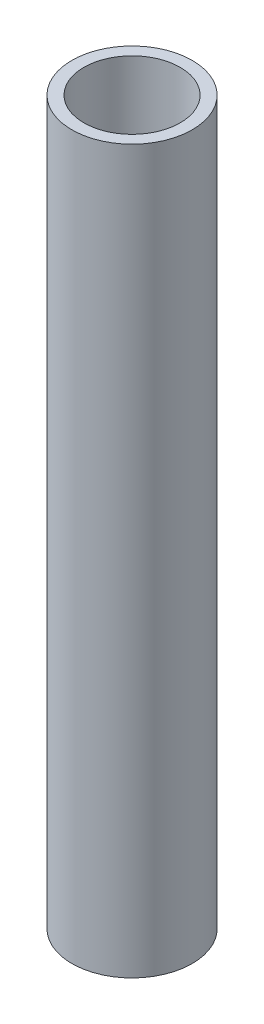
ISO-10303-21;
HEADER;
FILE_DESCRIPTION(('STEP AP214'),'2;1');
FILE_NAME('part.step','',(''),(''),'','','');
FILE_SCHEMA(('AUTOMOTIVE_DESIGN { 1 0 10303 214 1 1 1 1 }'));
ENDSEC;
DATA;
#1=APPLICATION_CONTEXT('core data for automotive mechanical design processes');
#2=APPLICATION_PROTOCOL_DEFINITION('international standard','automotive_design',2000,#1);
#3=PRODUCT_CONTEXT('',#1,'mechanical');
#4=PRODUCT('Part','Part','',(#3));
#5=PRODUCT_RELATED_PRODUCT_CATEGORY('part','',(#4));
#6=PRODUCT_DEFINITION_FORMATION('','',#4);
#7=PRODUCT_DEFINITION_CONTEXT('part definition',#1,'design');
#8=PRODUCT_DEFINITION('design','',#6,#7);
#9=PRODUCT_DEFINITION_SHAPE('','',#8);
#10=(LENGTH_UNIT() NAMED_UNIT(*) SI_UNIT(.MILLI.,.METRE.));
#11=(NAMED_UNIT(*) PLANE_ANGLE_UNIT() SI_UNIT($,.RADIAN.));
#12=(NAMED_UNIT(*) SI_UNIT($,.STERADIAN.) SOLID_ANGLE_UNIT());
#13=UNCERTAINTY_MEASURE_WITH_UNIT(LENGTH_MEASURE(1.E-05),#10,'distance_accuracy_value','');
#14=(GEOMETRIC_REPRESENTATION_CONTEXT(3) GLOBAL_UNCERTAINTY_ASSIGNED_CONTEXT((#13)) GLOBAL_UNIT_ASSIGNED_CONTEXT((#10,
#11,#12)) REPRESENTATION_CONTEXT('',''));
#15=CARTESIAN_POINT('',(0.,0.,0.));
#16=DIRECTION('',(0.,0.,1.));
#17=DIRECTION('',(1.,0.,0.));
#18=AXIS2_PLACEMENT_3D('',#15,#16,#17);
#19=CARTESIAN_POINT('',(0.,152.4,0.));
#20=DIRECTION('',(0.,1.,0.));
#21=DIRECTION('',(0.,0.,1.));
#22=AXIS2_PLACEMENT_3D('',#19,#20,#21);
#23=PLANE('',#22);
#24=CARTESIAN_POINT('',(0.,152.4,0.));
#25=DIRECTION('',(0.,1.,0.));
#26=DIRECTION('',(0.,0.,1.));
#27=AXIS2_PLACEMENT_3D('',#24,#25,#26);
#28=CIRCLE('',#27,12.7);
#29=CARTESIAN_POINT('',(0.,152.4,-12.7));
#30=VERTEX_POINT('',#29);
#31=EDGE_CURVE('E10',#30,#30,#28,.T.);
#32=ORIENTED_EDGE('',*,*,#31,.T.);
#33=EDGE_LOOP('',(#32));
#34=FACE_BOUND('',#33,.T.);
#35=CARTESIAN_POINT('',(0.,152.4,0.));
#36=DIRECTION('',(0.,1.,0.));
#37=DIRECTION('',(0.,0.,1.));
#38=AXIS2_PLACEMENT_3D('',#35,#36,#37);
#39=CIRCLE('',#38,10.16);
#40=CARTESIAN_POINT('',(0.,152.4,-10.16));
#41=VERTEX_POINT('',#40);
#42=EDGE_CURVE('E45',#41,#41,#39,.T.);
#43=ORIENTED_EDGE('',*,*,#42,.F.);
#44=EDGE_LOOP('',(#43));
#45=FACE_BOUND('',#44,.T.);
#46=ADVANCED_FACE('F34',(#34,#45),#23,.T.);
#47=CARTESIAN_POINT('',(0.,0.,0.));
#48=DIRECTION('',(0.,1.,0.));
#49=DIRECTION('',(0.,0.,1.));
#50=AXIS2_PLACEMENT_3D('',#47,#48,#49);
#51=PLANE('',#50);
#52=CARTESIAN_POINT('',(0.,0.,0.));
#53=DIRECTION('',(0.,1.,0.));
#54=DIRECTION('',(0.,0.,1.));
#55=AXIS2_PLACEMENT_3D('',#52,#53,#54);
#56=CIRCLE('',#55,12.7);
#57=CARTESIAN_POINT('',(0.,0.,-12.7));
#58=VERTEX_POINT('',#57);
#59=EDGE_CURVE('E38',#58,#58,#56,.T.);
#60=ORIENTED_EDGE('',*,*,#59,.F.);
#61=EDGE_LOOP('',(#60));
#62=FACE_BOUND('',#61,.T.);
#63=CARTESIAN_POINT('',(0.,0.,0.));
#64=DIRECTION('',(0.,1.,0.));
#65=DIRECTION('',(0.,0.,1.));
#66=AXIS2_PLACEMENT_3D('',#63,#64,#65);
#67=CIRCLE('',#66,10.16);
#68=CARTESIAN_POINT('',(0.,0.,-10.16));
#69=VERTEX_POINT('',#68);
#70=EDGE_CURVE('E47',#69,#69,#67,.T.);
#71=ORIENTED_EDGE('',*,*,#70,.T.);
#72=EDGE_LOOP('',(#71));
#73=FACE_BOUND('',#72,.T.);
#74=ADVANCED_FACE('F57',(#62,#73),#51,.F.);
#75=CARTESIAN_POINT('',(0.,152.4,0.));
#76=DIRECTION('',(0.,-1.,0.));
#77=DIRECTION('',(0.,0.,-1.));
#78=AXIS2_PLACEMENT_3D('',#75,#76,#77);
#79=CYLINDRICAL_SURFACE('',#78,12.7);
#80=CARTESIAN_POINT('',(0.,152.4,-12.7));
#81=CARTESIAN_POINT('',(0.,150.8125,-12.7));
#82=CARTESIAN_POINT('',(0.,149.225,-12.7));
#83=CARTESIAN_POINT('',(0.,146.05,-12.7));
#84=CARTESIAN_POINT('',(0.,144.4625,-12.7));
#85=CARTESIAN_POINT('',(0.,141.2875,-12.7));
#86=CARTESIAN_POINT('',(0.,139.7,-12.7));
#87=CARTESIAN_POINT('',(0.,136.525,-12.7));
#88=CARTESIAN_POINT('',(0.,134.9375,-12.7));
#89=CARTESIAN_POINT('',(0.,131.7625,-12.7));
#90=CARTESIAN_POINT('',(0.,130.175,-12.7));
#91=CARTESIAN_POINT('',(0.,127.,-12.7));
#92=CARTESIAN_POINT('',(0.,125.4125,-12.7));
#93=CARTESIAN_POINT('',(0.,122.2375,-12.7));
#94=CARTESIAN_POINT('',(0.,120.65,-12.7));
#95=CARTESIAN_POINT('',(0.,117.475,-12.7));
#96=CARTESIAN_POINT('',(0.,115.8875,-12.7));
#97=CARTESIAN_POINT('',(0.,112.7125,-12.7));
#98=CARTESIAN_POINT('',(0.,111.125,-12.7));
#99=CARTESIAN_POINT('',(0.,107.95,-12.7));
#100=CARTESIAN_POINT('',(0.,106.3625,-12.7));
#101=CARTESIAN_POINT('',(0.,103.1875,-12.7));
#102=CARTESIAN_POINT('',(0.,101.6,-12.7));
#103=CARTESIAN_POINT('',(0.,98.425,-12.7));
#104=CARTESIAN_POINT('',(0.,96.8375,-12.7));
#105=CARTESIAN_POINT('',(0.,93.6625,-12.7));
#106=CARTESIAN_POINT('',(0.,92.075,-12.7));
#107=CARTESIAN_POINT('',(0.,88.9,-12.7));
#108=CARTESIAN_POINT('',(0.,87.3125,-12.7));
#109=CARTESIAN_POINT('',(0.,84.1375,-12.7));
#110=CARTESIAN_POINT('',(0.,82.55,-12.7));
#111=CARTESIAN_POINT('',(0.,79.375,-12.7));
#112=CARTESIAN_POINT('',(0.,77.7875,-12.7));
#113=CARTESIAN_POINT('',(0.,74.6125,-12.7));
#114=CARTESIAN_POINT('',(0.,73.025,-12.7));
#115=CARTESIAN_POINT('',(0.,69.85,-12.7));
#116=CARTESIAN_POINT('',(0.,68.2625,-12.7));
#117=CARTESIAN_POINT('',(0.,65.0875,-12.7));
#118=CARTESIAN_POINT('',(0.,63.5,-12.7));
#119=CARTESIAN_POINT('',(0.,60.325,-12.7));
#120=CARTESIAN_POINT('',(0.,58.7375,-12.7));
#121=CARTESIAN_POINT('',(0.,55.5625,-12.7));
#122=CARTESIAN_POINT('',(0.,53.975,-12.7));
#123=CARTESIAN_POINT('',(0.,50.8,-12.7));
#124=CARTESIAN_POINT('',(0.,49.2125,-12.7));
#125=CARTESIAN_POINT('',(0.,46.0375,-12.7));
#126=CARTESIAN_POINT('',(0.,44.45,-12.7));
#127=CARTESIAN_POINT('',(0.,41.275,-12.7));
#128=CARTESIAN_POINT('',(0.,39.6875,-12.7));
#129=CARTESIAN_POINT('',(0.,36.5125,-12.7));
#130=CARTESIAN_POINT('',(0.,34.925,-12.7));
#131=CARTESIAN_POINT('',(0.,31.75,-12.7));
#132=CARTESIAN_POINT('',(0.,30.1625,-12.7));
#133=CARTESIAN_POINT('',(0.,26.9875,-12.7));
#134=CARTESIAN_POINT('',(0.,25.4,-12.7));
#135=CARTESIAN_POINT('',(0.,22.225,-12.7));
#136=CARTESIAN_POINT('',(0.,20.6375,-12.7));
#137=CARTESIAN_POINT('',(0.,17.4625,-12.7));
#138=CARTESIAN_POINT('',(0.,15.875,-12.7));
#139=CARTESIAN_POINT('',(0.,12.7,-12.7));
#140=CARTESIAN_POINT('',(0.,11.1125,-12.7));
#141=CARTESIAN_POINT('',(0.,7.93750000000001,-12.7));
#142=CARTESIAN_POINT('',(0.,6.35,-12.7));
#143=CARTESIAN_POINT('',(0.,3.175,-12.7));
#144=CARTESIAN_POINT('',(0.,1.5875,-12.7));
#145=CARTESIAN_POINT('',(0.,0.,-12.7));
#146=B_SPLINE_CURVE_WITH_KNOTS('',3,(#80,#81,#82,#83,#84,#85,#86,#87,#88,#89,#90,#91,#92,#93,
#94,#95,#96,#97,#98,#99,#100,#101,#102,#103,#104,#105,#106,#107,#108,#109,#110,#111,#112,#113,
#114,#115,#116,#117,#118,#119,#120,#121,#122,#123,#124,#125,#126,#127,#128,#129,#130,#131,#132,
#133,#134,#135,#136,#137,#138,#139,#140,#141,#142,#143,#144,#145),.UNSPECIFIED.,.F.,.F.,(4,2,2,
2,2,2,2,2,2,2,2,2,2,2,2,2,2,2,2,2,2,2,2,2,2,2,2,2,2,2,2,2,4),(0.,4.76249999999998,
9.52499999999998,14.2875,19.05,23.8125,28.575,33.3375,38.1,42.8625,47.625,52.3875,57.15,61.9125,
66.675,71.4375,76.2,80.9625,85.725,90.4875,95.25,100.0125,104.775,109.5375,114.3,119.0625,
123.825,128.5875,133.35,138.1125,142.875,147.6375,152.4),.UNSPECIFIED.);
#147=EDGE_CURVE('BSEAM36',#30,#58,#146,.T.);
#148=ORIENTED_EDGE('',*,*,#31,.F.);
#149=ORIENTED_EDGE('',*,*,#59,.T.);
#150=ORIENTED_EDGE('',*,*,#147,.T.);
#151=ORIENTED_EDGE('',*,*,#147,.F.);
#152=EDGE_LOOP('',(#148,#150,#149,#151));
#153=FACE_BOUND('',#152,.T.);
#154=ADVANCED_FACE('F36',(#153),#79,.T.);
#155=CARTESIAN_POINT('',(0.,152.4,0.));
#156=DIRECTION('',(0.,-1.,0.));
#157=DIRECTION('',(0.,0.,-1.));
#158=AXIS2_PLACEMENT_3D('',#155,#156,#157);
#159=CYLINDRICAL_SURFACE('',#158,10.16);
#160=CARTESIAN_POINT('',(0.,152.4,-10.16));
#161=CARTESIAN_POINT('',(0.,150.8125,-10.16));
#162=CARTESIAN_POINT('',(0.,149.225,-10.16));
#163=CARTESIAN_POINT('',(0.,146.05,-10.16));
#164=CARTESIAN_POINT('',(0.,144.4625,-10.16));
#165=CARTESIAN_POINT('',(0.,141.2875,-10.16));
#166=CARTESIAN_POINT('',(0.,139.7,-10.16));
#167=CARTESIAN_POINT('',(0.,136.525,-10.16));
#168=CARTESIAN_POINT('',(0.,134.9375,-10.16));
#169=CARTESIAN_POINT('',(0.,131.7625,-10.16));
#170=CARTESIAN_POINT('',(0.,130.175,-10.16));
#171=CARTESIAN_POINT('',(0.,127.,-10.16));
#172=CARTESIAN_POINT('',(0.,125.4125,-10.16));
#173=CARTESIAN_POINT('',(0.,122.2375,-10.16));
#174=CARTESIAN_POINT('',(0.,120.65,-10.16));
#175=CARTESIAN_POINT('',(0.,117.475,-10.16));
#176=CARTESIAN_POINT('',(0.,115.8875,-10.16));
#177=CARTESIAN_POINT('',(0.,112.7125,-10.16));
#178=CARTESIAN_POINT('',(0.,111.125,-10.16));
#179=CARTESIAN_POINT('',(0.,107.95,-10.16));
#180=CARTESIAN_POINT('',(0.,106.3625,-10.16));
#181=CARTESIAN_POINT('',(0.,103.1875,-10.16));
#182=CARTESIAN_POINT('',(0.,101.6,-10.16));
#183=CARTESIAN_POINT('',(0.,98.425,-10.16));
#184=CARTESIAN_POINT('',(0.,96.8375,-10.16));
#185=CARTESIAN_POINT('',(0.,93.6625,-10.16));
#186=CARTESIAN_POINT('',(0.,92.075,-10.16));
#187=CARTESIAN_POINT('',(0.,88.9,-10.16));
#188=CARTESIAN_POINT('',(0.,87.3125,-10.16));
#189=CARTESIAN_POINT('',(0.,84.1375,-10.16));
#190=CARTESIAN_POINT('',(0.,82.55,-10.16));
#191=CARTESIAN_POINT('',(0.,79.375,-10.16));
#192=CARTESIAN_POINT('',(0.,77.7875,-10.16));
#193=CARTESIAN_POINT('',(0.,74.6125,-10.16));
#194=CARTESIAN_POINT('',(0.,73.025,-10.16));
#195=CARTESIAN_POINT('',(0.,69.85,-10.16));
#196=CARTESIAN_POINT('',(0.,68.2625,-10.16));
#197=CARTESIAN_POINT('',(0.,65.0875,-10.16));
#198=CARTESIAN_POINT('',(0.,63.5,-10.16));
#199=CARTESIAN_POINT('',(0.,60.325,-10.16));
#200=CARTESIAN_POINT('',(0.,58.7375,-10.16));
#201=CARTESIAN_POINT('',(0.,55.5625,-10.16));
#202=CARTESIAN_POINT('',(0.,53.975,-10.16));
#203=CARTESIAN_POINT('',(0.,50.8,-10.16));
#204=CARTESIAN_POINT('',(0.,49.2125,-10.16));
#205=CARTESIAN_POINT('',(0.,46.0375,-10.16));
#206=CARTESIAN_POINT('',(0.,44.45,-10.16));
#207=CARTESIAN_POINT('',(0.,41.275,-10.16));
#208=CARTESIAN_POINT('',(0.,39.6875,-10.16));
#209=CARTESIAN_POINT('',(0.,36.5125,-10.16));
#210=CARTESIAN_POINT('',(0.,34.925,-10.16));
#211=CARTESIAN_POINT('',(0.,31.75,-10.16));
#212=CARTESIAN_POINT('',(0.,30.1625,-10.16));
#213=CARTESIAN_POINT('',(0.,26.9875,-10.16));
#214=CARTESIAN_POINT('',(0.,25.4,-10.16));
#215=CARTESIAN_POINT('',(0.,22.225,-10.16));
#216=CARTESIAN_POINT('',(0.,20.6375,-10.16));
#217=CARTESIAN_POINT('',(0.,17.4625,-10.16));
#218=CARTESIAN_POINT('',(0.,15.875,-10.16));
#219=CARTESIAN_POINT('',(0.,12.7,-10.16));
#220=CARTESIAN_POINT('',(0.,11.1125,-10.16));
#221=CARTESIAN_POINT('',(0.,7.93750000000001,-10.16));
#222=CARTESIAN_POINT('',(0.,6.35,-10.16));
#223=CARTESIAN_POINT('',(0.,3.175,-10.16));
#224=CARTESIAN_POINT('',(0.,1.5875,-10.16));
#225=CARTESIAN_POINT('',(0.,0.,-10.16));
#226=B_SPLINE_CURVE_WITH_KNOTS('',3,(#160,#161,#162,#163,#164,#165,#166,#167,#168,#169,#170,
#171,#172,#173,#174,#175,#176,#177,#178,#179,#180,#181,#182,#183,#184,#185,#186,#187,#188,#189,
#190,#191,#192,#193,#194,#195,#196,#197,#198,#199,#200,#201,#202,#203,#204,#205,#206,#207,#208,
#209,#210,#211,#212,#213,#214,#215,#216,#217,#218,#219,#220,#221,#222,#223,#224,#225),
.UNSPECIFIED.,.F.,.F.,(4,2,2,2,2,2,2,2,2,2,2,2,2,2,2,2,2,2,2,2,2,2,2,2,2,2,2,2,2,2,2,2,4),(0.,
4.76249999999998,9.52499999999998,14.2875,19.05,23.8125,28.575,33.3375,38.1,42.8625,47.625,
52.3875,57.15,61.9125,66.675,71.4375,76.2,80.9625,85.725,90.4875,95.25,100.0125,104.775,
109.5375,114.3,119.0625,123.825,128.5875,133.35,138.1125,142.875,147.6375,152.4),.UNSPECIFIED.);
#227=EDGE_CURVE('BSEAM53',#41,#69,#226,.T.);
#228=ORIENTED_EDGE('',*,*,#42,.T.);
#229=ORIENTED_EDGE('',*,*,#70,.F.);
#230=ORIENTED_EDGE('',*,*,#227,.T.);
#231=ORIENTED_EDGE('',*,*,#227,.F.);
#232=EDGE_LOOP('',(#228,#230,#229,#231));
#233=FACE_BOUND('',#232,.T.);
#234=ADVANCED_FACE('F53',(#233),#159,.F.);
#235=CLOSED_SHELL('',(#46,#74,#154,#234));
#236=MANIFOLD_SOLID_BREP('B2',#235);
#237=ADVANCED_BREP_SHAPE_REPRESENTATION('',(#18,#236),#14);
#238=SHAPE_DEFINITION_REPRESENTATION(#9,#237);
ENDSEC;
END-ISO-10303-21;
